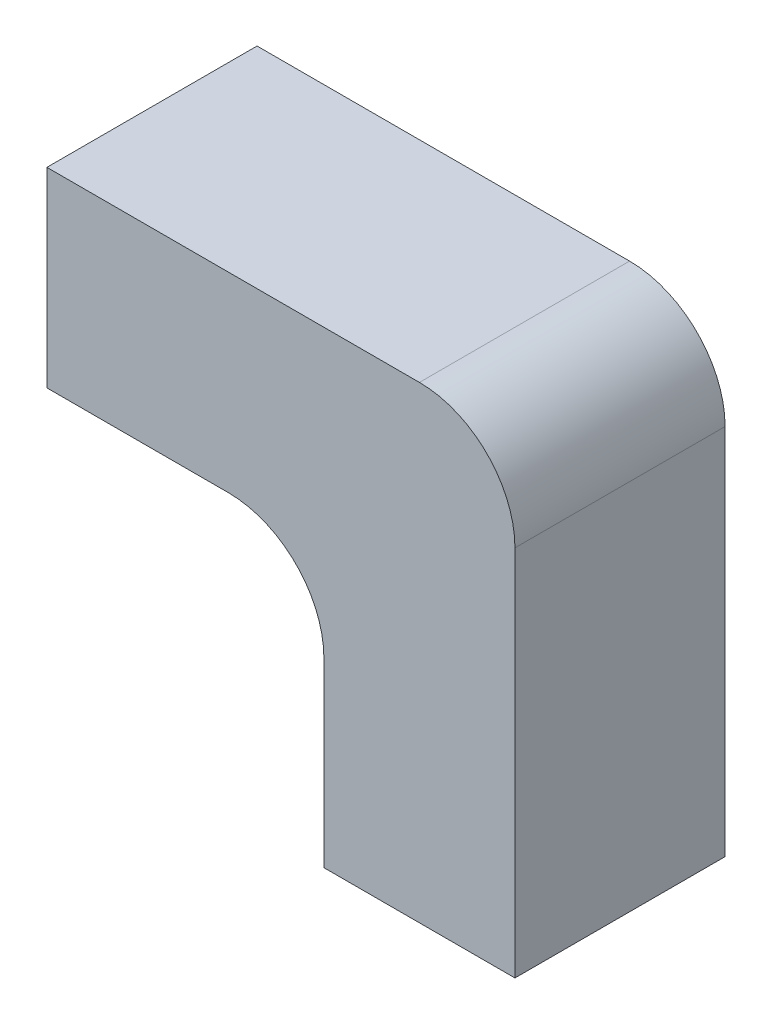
from build123d import *

# Parameters (mm, degrees)
BOSS_EXTRUDE1_DEPTH = 2.2
FILLET1_R           = 1


with BuildPart() as part:
    # Sketch1 → Boss-Extrude1 (new body)
    with BuildSketch(Plane.XY):
        Polygon((-1.551376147, -0.268348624), (1.348623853, -0.268348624), (1.348623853, -3.168348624), (3.348623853, -3.168348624), (3.348623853, 1.731651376), (-1.551376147, 1.731651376), align=None)
    extrude(amount=BOSS_EXTRUDE1_DEPTH)

    # Fillet1
    fillet1_edges = [part.edges().sort_by_distance(p)[0] for p in [
        (3.348623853, 1.731651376, 1.1),
        (1.348623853, -0.268348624, 1.1),
    ]]
    fillet(fillet1_edges, radius=FILLET1_R)


solid = part.part
